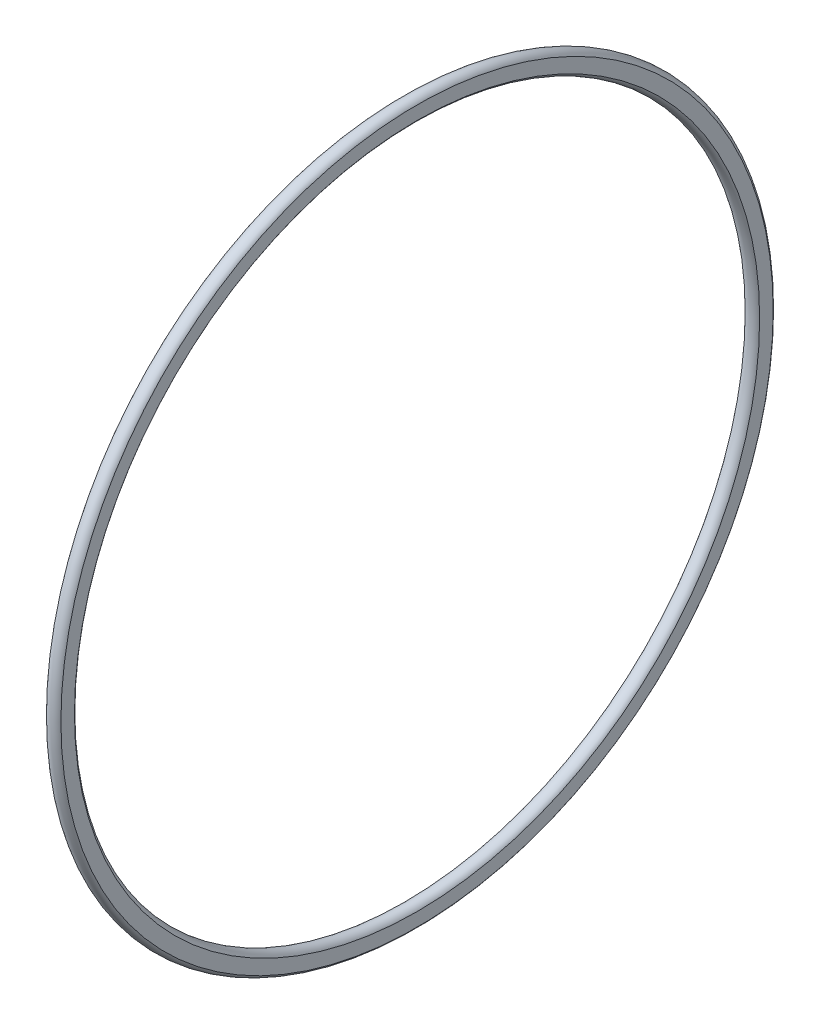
from build123d import *


with BuildPart() as part:
    # Sketch1 → Revolve1 (revolve)
    with BuildSketch(Plane.XY, mode=Mode.PRIVATE) as revolve1_sk:
        with BuildLine():
            Line((0, 48.159671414), (0, 50.062128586))
            ThreePointArc((0, 50.062128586), (-0.9906, 50.6349), (-1.9812, 50.062128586))
            Line((-1.9812, 50.062128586), (-1.9812, 48.159671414))
            ThreePointArc((-1.9812, 48.159671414), (-0.9906, 47.5869), (0, 48.159671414))
        make_face()
    revolve(revolve1_sk.sketch.rotate(Axis((0, 0, 0), (-1, 0, 0)), 90), axis=Axis((0, 0, 0), (-1, 0, 0)))


solid = part.part
